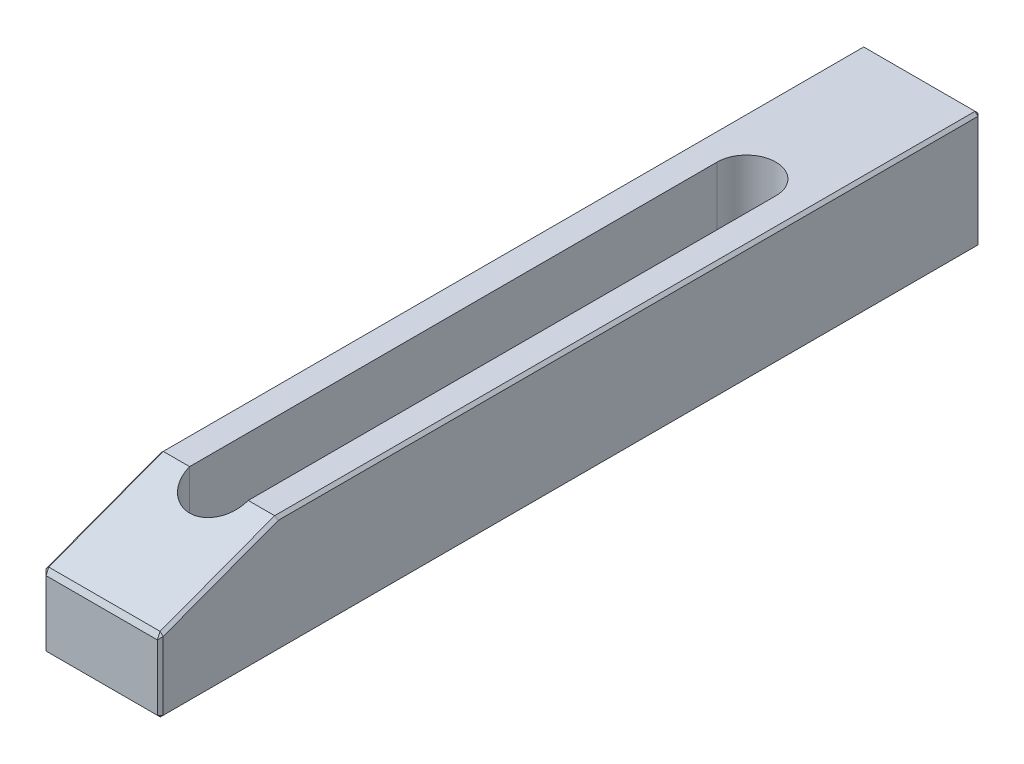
ISO-10303-21;
HEADER;
FILE_DESCRIPTION(('STEP AP214'),'2;1');
FILE_NAME('part.step','',(''),(''),'','','');
FILE_SCHEMA(('AUTOMOTIVE_DESIGN { 1 0 10303 214 1 1 1 1 }'));
ENDSEC;
DATA;
#1=APPLICATION_CONTEXT('core data for automotive mechanical design processes');
#2=APPLICATION_PROTOCOL_DEFINITION('international standard','automotive_design',2000,#1);
#3=PRODUCT_CONTEXT('',#1,'mechanical');
#4=PRODUCT('Part','Part','',(#3));
#5=PRODUCT_RELATED_PRODUCT_CATEGORY('part','',(#4));
#6=PRODUCT_DEFINITION_FORMATION('','',#4);
#7=PRODUCT_DEFINITION_CONTEXT('part definition',#1,'design');
#8=PRODUCT_DEFINITION('design','',#6,#7);
#9=PRODUCT_DEFINITION_SHAPE('','',#8);
#10=(LENGTH_UNIT() NAMED_UNIT(*) SI_UNIT(.MILLI.,.METRE.));
#11=(NAMED_UNIT(*) PLANE_ANGLE_UNIT() SI_UNIT($,.RADIAN.));
#12=(NAMED_UNIT(*) SI_UNIT($,.STERADIAN.) SOLID_ANGLE_UNIT());
#13=UNCERTAINTY_MEASURE_WITH_UNIT(LENGTH_MEASURE(1.E-05),#10,'distance_accuracy_value','');
#14=(GEOMETRIC_REPRESENTATION_CONTEXT(3) GLOBAL_UNCERTAINTY_ASSIGNED_CONTEXT((#13)) GLOBAL_UNIT_ASSIGNED_CONTEXT((#10,
#11,#12)) REPRESENTATION_CONTEXT('',''));
#15=CARTESIAN_POINT('',(0.,0.,0.));
#16=DIRECTION('',(0.,0.,1.));
#17=DIRECTION('',(1.,0.,0.));
#18=AXIS2_PLACEMENT_3D('',#15,#16,#17);
#19=CARTESIAN_POINT('',(20.,0.,0.));
#20=DIRECTION('',(0.,0.,1.));
#21=DIRECTION('',(1.,0.,0.));
#22=AXIS2_PLACEMENT_3D('',#19,#20,#21);
#23=PLANE('',#22);
#24=DIRECTION('',(0.,-1.,0.));
#25=VECTOR('',#24,1.);
#26=CARTESIAN_POINT('',(19.,0.,0.));
#27=LINE('',#26,#25);
#28=CARTESIAN_POINT('',(19.,39.,0.));
#29=VERTEX_POINT('',#28);
#30=CARTESIAN_POINT('',(19.,1.00000000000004,0.));
#31=VERTEX_POINT('',#30);
#32=EDGE_CURVE('E249',#29,#31,#27,.T.);
#33=ORIENTED_EDGE('',*,*,#32,.T.);
#34=DIRECTION('',(-1.,0.,0.));
#35=VECTOR('',#34,1.);
#36=CARTESIAN_POINT('',(20.,1.00000000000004,0.));
#37=LINE('',#36,#35);
#38=CARTESIAN_POINT('',(-19.,1.00000000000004,0.));
#39=VERTEX_POINT('',#38);
#40=EDGE_CURVE('E251',#31,#39,#37,.T.);
#41=ORIENTED_EDGE('',*,*,#40,.T.);
#42=DIRECTION('',(0.,1.,0.));
#43=VECTOR('',#42,1.);
#44=CARTESIAN_POINT('',(-19.,0.,0.));
#45=LINE('',#44,#43);
#46=CARTESIAN_POINT('',(-19.,39.,0.));
#47=VERTEX_POINT('',#46);
#48=EDGE_CURVE('E247',#39,#47,#45,.T.);
#49=ORIENTED_EDGE('',*,*,#48,.T.);
#50=DIRECTION('',(1.,0.,0.));
#51=VECTOR('',#50,1.);
#52=CARTESIAN_POINT('',(20.,39.,0.));
#53=LINE('',#52,#51);
#54=EDGE_CURVE('E245',#47,#29,#53,.T.);
#55=ORIENTED_EDGE('',*,*,#54,.T.);
#56=EDGE_LOOP('',(#33,#41,#49,#55));
#57=FACE_BOUND('',#56,.T.);
#58=ADVANCED_FACE('F30',(#57),#23,.F.);
#59=CARTESIAN_POINT('',(20.,40.,0.));
#60=DIRECTION('',(0.,-1.,0.));
#61=DIRECTION('',(0.,0.,-1.));
#62=AXIS2_PLACEMENT_3D('',#59,#60,#61);
#63=PLANE('',#62);
#64=CARTESIAN_POINT('',(0.,40.,60.));
#65=DIRECTION('',(0.,-1.,0.));
#66=DIRECTION('',(0.,0.,-1.));
#67=AXIS2_PLACEMENT_3D('',#64,#65,#66);
#68=CIRCLE('',#67,10.);
#69=CARTESIAN_POINT('',(-9.99999999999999,40.,60.));
#70=VERTEX_POINT('',#69);
#71=CARTESIAN_POINT('',(10.,40.,60.));
#72=VERTEX_POINT('',#71);
#73=EDGE_CURVE('E167',#70,#72,#68,.T.);
#74=ORIENTED_EDGE('',*,*,#73,.T.);
#75=DIRECTION('',(0.,0.,1.));
#76=VECTOR('',#75,1.);
#77=CARTESIAN_POINT('',(9.99999999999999,40.,240.));
#78=LINE('',#77,#76);
#79=CARTESIAN_POINT('',(9.99999999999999,40.,240.));
#80=VERTEX_POINT('',#79);
#81=EDGE_CURVE('E172',#72,#80,#78,.T.);
#82=ORIENTED_EDGE('',*,*,#81,.T.);
#83=DIRECTION('',(-1.,0.,0.));
#84=VECTOR('',#83,1.);
#85=CARTESIAN_POINT('',(20.,40.,240.));
#86=LINE('',#85,#84);
#87=CARTESIAN_POINT('',(19.,40.,240.));
#88=VERTEX_POINT('',#87);
#89=EDGE_CURVE('E195',#88,#80,#86,.T.);
#90=ORIENTED_EDGE('',*,*,#89,.F.);
#91=DIRECTION('',(0.,0.,-1.));
#92=VECTOR('',#91,1.);
#93=CARTESIAN_POINT('',(19.,40.,0.));
#94=LINE('',#93,#92);
#95=CARTESIAN_POINT('',(19.,40.,1.00000000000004));
#96=VERTEX_POINT('',#95);
#97=EDGE_CURVE('E254',#88,#96,#94,.T.);
#98=ORIENTED_EDGE('',*,*,#97,.T.);
#99=DIRECTION('',(-1.,0.,0.));
#100=VECTOR('',#99,1.);
#101=CARTESIAN_POINT('',(20.,40.,1.00000000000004));
#102=LINE('',#101,#100);
#103=CARTESIAN_POINT('',(-19.,40.,1.00000000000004));
#104=VERTEX_POINT('',#103);
#105=EDGE_CURVE('E39',#96,#104,#102,.T.);
#106=ORIENTED_EDGE('',*,*,#105,.T.);
#107=DIRECTION('',(0.,0.,1.));
#108=VECTOR('',#107,1.);
#109=CARTESIAN_POINT('',(-19.,40.,0.));
#110=LINE('',#109,#108);
#111=CARTESIAN_POINT('',(-19.,40.,240.));
#112=VERTEX_POINT('',#111);
#113=EDGE_CURVE('E11',#104,#112,#110,.T.);
#114=ORIENTED_EDGE('',*,*,#113,.T.);
#115=CARTESIAN_POINT('',(-10.,40.,240.));
#116=VERTEX_POINT('',#115);
#117=EDGE_CURVE('E176',#116,#112,#86,.T.);
#118=ORIENTED_EDGE('',*,*,#117,.F.);
#119=DIRECTION('',(0.,0.,-1.));
#120=VECTOR('',#119,1.);
#121=CARTESIAN_POINT('',(-10.,40.,240.));
#122=LINE('',#121,#120);
#123=EDGE_CURVE('E47',#116,#70,#122,.T.);
#124=ORIENTED_EDGE('',*,*,#123,.T.);
#125=EDGE_LOOP('',(#74,#82,#90,#98,#106,#114,#118,#124));
#126=FACE_BOUND('',#125,.T.);
#127=ADVANCED_FACE('F175',(#126),#63,.F.);
#128=CARTESIAN_POINT('',(20.,25.,280.));
#129=DIRECTION('',(0.,-0.936329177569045,-0.351123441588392));
#130=DIRECTION('',(0.,0.351123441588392,-0.936329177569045));
#131=AXIS2_PLACEMENT_3D('',#128,#129,#130);
#132=PLANE('',#131);
#133=ORIENTED_EDGE('',*,*,#89,.T.);
#134=CARTESIAN_POINT('',(0.,40.,240.));
#135=DIRECTION('',(0.,-0.936329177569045,-0.351123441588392));
#136=DIRECTION('',(0.,-0.351123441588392,0.936329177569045));
#137=AXIS2_PLACEMENT_3D('',#134,#135,#136);
#138=ELLIPSE('',#137,10.6800046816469,10.);
#139=EDGE_CURVE('E189',#80,#116,#138,.T.);
#140=ORIENTED_EDGE('',*,*,#139,.T.);
#141=ORIENTED_EDGE('',*,*,#117,.T.);
#142=DIRECTION('',(0.,-0.351123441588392,0.936329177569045));
#143=VECTOR('',#142,1.);
#144=CARTESIAN_POINT('',(-19.,25.,280.));
#145=LINE('',#144,#143);
#146=CARTESIAN_POINT('',(-19.,25.3511234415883,279.063670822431));
#147=VERTEX_POINT('',#146);
#148=EDGE_CURVE('E212',#112,#147,#145,.T.);
#149=ORIENTED_EDGE('',*,*,#148,.T.);
#150=DIRECTION('',(1.,0.,0.));
#151=VECTOR('',#150,1.);
#152=CARTESIAN_POINT('',(20.,25.3511234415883,279.063670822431));
#153=LINE('',#152,#151);
#154=CARTESIAN_POINT('',(19.,25.3511234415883,279.063670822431));
#155=VERTEX_POINT('',#154);
#156=EDGE_CURVE('E209',#147,#155,#153,.T.);
#157=ORIENTED_EDGE('',*,*,#156,.T.);
#158=DIRECTION('',(0.,0.351123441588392,-0.936329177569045));
#159=VECTOR('',#158,1.);
#160=CARTESIAN_POINT('',(19.,40.,240.));
#161=LINE('',#160,#159);
#162=EDGE_CURVE('E207',#155,#88,#161,.T.);
#163=ORIENTED_EDGE('',*,*,#162,.T.);
#164=EDGE_LOOP('',(#133,#140,#141,#149,#157,#163));
#165=FACE_BOUND('',#164,.T.);
#166=ADVANCED_FACE('F330',(#165),#132,.F.);
#167=CARTESIAN_POINT('',(20.,0.,280.));
#168=DIRECTION('',(0.,0.,-1.));
#169=DIRECTION('',(-1.,0.,0.));
#170=AXIS2_PLACEMENT_3D('',#167,#168,#169);
#171=PLANE('',#170);
#172=DIRECTION('',(0.,1.,0.));
#173=VECTOR('',#172,1.);
#174=CARTESIAN_POINT('',(19.,25.,280.));
#175=LINE('',#174,#173);
#176=CARTESIAN_POINT('',(19.,0.999999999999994,280.));
#177=VERTEX_POINT('',#176);
#178=CARTESIAN_POINT('',(19.,23.2911992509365,280.));
#179=VERTEX_POINT('',#178);
#180=EDGE_CURVE('E202',#177,#179,#175,.T.);
#181=ORIENTED_EDGE('',*,*,#180,.T.);
#182=DIRECTION('',(-1.,0.,0.));
#183=VECTOR('',#182,1.);
#184=CARTESIAN_POINT('',(20.,23.2911992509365,280.));
#185=LINE('',#184,#183);
#186=CARTESIAN_POINT('',(-19.,23.2911992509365,280.));
#187=VERTEX_POINT('',#186);
#188=EDGE_CURVE('E204',#179,#187,#185,.T.);
#189=ORIENTED_EDGE('',*,*,#188,.T.);
#190=DIRECTION('',(0.,-1.,0.));
#191=VECTOR('',#190,1.);
#192=CARTESIAN_POINT('',(-19.,0.,280.));
#193=LINE('',#192,#191);
#194=CARTESIAN_POINT('',(-19.,0.999999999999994,280.));
#195=VERTEX_POINT('',#194);
#196=EDGE_CURVE('E200',#187,#195,#193,.T.);
#197=ORIENTED_EDGE('',*,*,#196,.T.);
#198=DIRECTION('',(1.,0.,0.));
#199=VECTOR('',#198,1.);
#200=CARTESIAN_POINT('',(20.,0.999999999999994,280.));
#201=LINE('',#200,#199);
#202=EDGE_CURVE('E198',#195,#177,#201,.T.);
#203=ORIENTED_EDGE('',*,*,#202,.T.);
#204=EDGE_LOOP('',(#181,#189,#197,#203));
#205=FACE_BOUND('',#204,.T.);
#206=ADVANCED_FACE('F359',(#205),#171,.F.);
#207=CARTESIAN_POINT('',(20.,0.,0.));
#208=DIRECTION('',(0.,1.,0.));
#209=DIRECTION('',(0.,0.,1.));
#210=AXIS2_PLACEMENT_3D('',#207,#208,#209);
#211=PLANE('',#210);
#212=DIRECTION('',(0.,0.,-1.));
#213=VECTOR('',#212,1.);
#214=CARTESIAN_POINT('',(-10.,0.,240.));
#215=LINE('',#214,#213);
#216=CARTESIAN_POINT('',(-10.,0.,240.));
#217=VERTEX_POINT('',#216);
#218=CARTESIAN_POINT('',(-9.99999999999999,0.,60.));
#219=VERTEX_POINT('',#218);
#220=EDGE_CURVE('E159',#217,#219,#215,.T.);
#221=ORIENTED_EDGE('',*,*,#220,.F.);
#222=CARTESIAN_POINT('',(0.,0.,240.));
#223=DIRECTION('',(0.,-1.,0.));
#224=DIRECTION('',(0.,0.,-1.));
#225=AXIS2_PLACEMENT_3D('',#222,#223,#224);
#226=CIRCLE('',#225,10.);
#227=CARTESIAN_POINT('',(9.99999999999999,0.,240.));
#228=VERTEX_POINT('',#227);
#229=EDGE_CURVE('E54',#228,#217,#226,.T.);
#230=ORIENTED_EDGE('',*,*,#229,.F.);
#231=DIRECTION('',(0.,0.,1.));
#232=VECTOR('',#231,1.);
#233=CARTESIAN_POINT('',(9.99999999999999,0.,240.));
#234=LINE('',#233,#232);
#235=CARTESIAN_POINT('',(10.,0.,60.));
#236=VERTEX_POINT('',#235);
#237=EDGE_CURVE('E177',#236,#228,#234,.T.);
#238=ORIENTED_EDGE('',*,*,#237,.F.);
#239=CARTESIAN_POINT('',(0.,0.,60.));
#240=DIRECTION('',(0.,-1.,0.));
#241=DIRECTION('',(0.,0.,-1.));
#242=AXIS2_PLACEMENT_3D('',#239,#240,#241);
#243=CIRCLE('',#242,10.);
#244=EDGE_CURVE('E180',#219,#236,#243,.T.);
#245=ORIENTED_EDGE('',*,*,#244,.F.);
#246=EDGE_LOOP('',(#221,#230,#238,#245));
#247=FACE_BOUND('',#246,.T.);
#248=DIRECTION('',(0.,0.,1.));
#249=VECTOR('',#248,1.);
#250=CARTESIAN_POINT('',(19.,0.,280.));
#251=LINE('',#250,#249);
#252=CARTESIAN_POINT('',(19.,0.,1.00000000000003));
#253=VERTEX_POINT('',#252);
#254=CARTESIAN_POINT('',(19.,0.,279.));
#255=VERTEX_POINT('',#254);
#256=EDGE_CURVE('E240',#253,#255,#251,.T.);
#257=ORIENTED_EDGE('',*,*,#256,.T.);
#258=DIRECTION('',(-1.,0.,0.));
#259=VECTOR('',#258,1.);
#260=CARTESIAN_POINT('',(20.,0.,279.));
#261=LINE('',#260,#259);
#262=CARTESIAN_POINT('',(-19.,0.,279.));
#263=VERTEX_POINT('',#262);
#264=EDGE_CURVE('E242',#255,#263,#261,.T.);
#265=ORIENTED_EDGE('',*,*,#264,.T.);
#266=DIRECTION('',(0.,0.,-1.));
#267=VECTOR('',#266,1.);
#268=CARTESIAN_POINT('',(-19.,0.,0.));
#269=LINE('',#268,#267);
#270=CARTESIAN_POINT('',(-19.,0.,1.00000000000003));
#271=VERTEX_POINT('',#270);
#272=EDGE_CURVE('E238',#263,#271,#269,.T.);
#273=ORIENTED_EDGE('',*,*,#272,.T.);
#274=DIRECTION('',(1.,0.,0.));
#275=VECTOR('',#274,1.);
#276=CARTESIAN_POINT('',(20.,0.,1.00000000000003));
#277=LINE('',#276,#275);
#278=EDGE_CURVE('E236',#271,#253,#277,.T.);
#279=ORIENTED_EDGE('',*,*,#278,.T.);
#280=EDGE_LOOP('',(#257,#265,#273,#279));
#281=FACE_BOUND('',#280,.T.);
#282=ADVANCED_FACE('F659',(#247,#281),#211,.F.);
#283=CARTESIAN_POINT('',(20.,40.,0.));
#284=DIRECTION('',(1.,0.,0.));
#285=DIRECTION('',(0.,0.,-1.));
#286=AXIS2_PLACEMENT_3D('',#283,#284,#285);
#287=PLANE('',#286);
#288=DIRECTION('',(0.,-0.351123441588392,0.936329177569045));
#289=VECTOR('',#288,1.);
#290=CARTESIAN_POINT('',(20.,24.0636708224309,279.648876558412));
#291=LINE('',#290,#289);
#292=CARTESIAN_POINT('',(20.,38.9999999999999,239.818665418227));
#293=VERTEX_POINT('',#292);
#294=CARTESIAN_POINT('',(20.,24.3069995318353,279.));
#295=VERTEX_POINT('',#294);
#296=EDGE_CURVE('E214',#293,#295,#291,.T.);
#297=ORIENTED_EDGE('',*,*,#296,.T.);
#298=DIRECTION('',(0.,-1.,0.));
#299=VECTOR('',#298,1.);
#300=CARTESIAN_POINT('',(20.,0.,279.));
#301=LINE('',#300,#299);
#302=CARTESIAN_POINT('',(20.,1.00000000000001,279.));
#303=VERTEX_POINT('',#302);
#304=EDGE_CURVE('E222',#295,#303,#301,.T.);
#305=ORIENTED_EDGE('',*,*,#304,.T.);
#306=DIRECTION('',(0.,0.,-1.));
#307=VECTOR('',#306,1.);
#308=CARTESIAN_POINT('',(20.,1.00000000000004,0.));
#309=LINE('',#308,#307);
#310=CARTESIAN_POINT('',(20.,1.00000000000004,1.00000000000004));
#311=VERTEX_POINT('',#310);
#312=EDGE_CURVE('E220',#303,#311,#309,.T.);
#313=ORIENTED_EDGE('',*,*,#312,.T.);
#314=DIRECTION('',(0.,1.,0.));
#315=VECTOR('',#314,1.);
#316=CARTESIAN_POINT('',(20.,40.,1.00000000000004));
#317=LINE('',#316,#315);
#318=CARTESIAN_POINT('',(20.,39.,1.00000000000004));
#319=VERTEX_POINT('',#318);
#320=EDGE_CURVE('E218',#311,#319,#317,.T.);
#321=ORIENTED_EDGE('',*,*,#320,.T.);
#322=DIRECTION('',(0.,0.,1.));
#323=VECTOR('',#322,1.);
#324=CARTESIAN_POINT('',(20.,38.9999999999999,240.));
#325=LINE('',#324,#323);
#326=EDGE_CURVE('E216',#319,#293,#325,.T.);
#327=ORIENTED_EDGE('',*,*,#326,.T.);
#328=EDGE_LOOP('',(#297,#305,#313,#321,#327));
#329=FACE_BOUND('',#328,.T.);
#330=ADVANCED_FACE('F419',(#329),#287,.T.);
#331=CARTESIAN_POINT('',(-20.,40.,0.));
#332=DIRECTION('',(1.,0.,0.));
#333=DIRECTION('',(0.,0.,-1.));
#334=AXIS2_PLACEMENT_3D('',#331,#332,#333);
#335=PLANE('',#334);
#336=DIRECTION('',(0.,0.,1.));
#337=VECTOR('',#336,1.);
#338=CARTESIAN_POINT('',(-20.,1.00000000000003,0.));
#339=LINE('',#338,#337);
#340=CARTESIAN_POINT('',(-20.,1.00000000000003,1.00000000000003));
#341=VERTEX_POINT('',#340);
#342=CARTESIAN_POINT('',(-20.,0.999999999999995,279.));
#343=VERTEX_POINT('',#342);
#344=EDGE_CURVE('E231',#341,#343,#339,.T.);
#345=ORIENTED_EDGE('',*,*,#344,.T.);
#346=DIRECTION('',(0.,1.,0.));
#347=VECTOR('',#346,1.);
#348=CARTESIAN_POINT('',(-20.,40.,279.));
#349=LINE('',#348,#347);
#350=CARTESIAN_POINT('',(-20.,24.3069995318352,279.));
#351=VERTEX_POINT('',#350);
#352=EDGE_CURVE('E233',#343,#351,#349,.T.);
#353=ORIENTED_EDGE('',*,*,#352,.T.);
#354=DIRECTION('',(0.,0.351123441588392,-0.936329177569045));
#355=VECTOR('',#354,1.);
#356=CARTESIAN_POINT('',(-20.,117.967780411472,29.237917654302));
#357=LINE('',#356,#355);
#358=CARTESIAN_POINT('',(-20.,38.9999999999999,239.818665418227));
#359=VERTEX_POINT('',#358);
#360=EDGE_CURVE('E227',#351,#359,#357,.T.);
#361=ORIENTED_EDGE('',*,*,#360,.T.);
#362=DIRECTION('',(0.,0.,-1.));
#363=VECTOR('',#362,1.);
#364=CARTESIAN_POINT('',(-20.,39.,0.));
#365=LINE('',#364,#363);
#366=CARTESIAN_POINT('',(-20.,39.,1.00000000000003));
#367=VERTEX_POINT('',#366);
#368=EDGE_CURVE('E225',#359,#367,#365,.T.);
#369=ORIENTED_EDGE('',*,*,#368,.T.);
#370=DIRECTION('',(0.,-1.,0.));
#371=VECTOR('',#370,1.);
#372=CARTESIAN_POINT('',(-20.,40.,1.00000000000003));
#373=LINE('',#372,#371);
#374=EDGE_CURVE('E229',#367,#341,#373,.T.);
#375=ORIENTED_EDGE('',*,*,#374,.T.);
#376=EDGE_LOOP('',(#345,#353,#361,#369,#375));
#377=FACE_BOUND('',#376,.T.);
#378=ADVANCED_FACE('F397',(#377),#335,.F.);
#379=CARTESIAN_POINT('',(20.,1.00000000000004,0.));
#380=DIRECTION('',(0.,0.707106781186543,0.707106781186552));
#381=DIRECTION('',(0.,-0.707106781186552,0.707106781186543));
#382=AXIS2_PLACEMENT_3D('',#379,#380,#381);
#383=PLANE('',#382);
#384=DIRECTION('',(0.,0.707106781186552,-0.707106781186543));
#385=VECTOR('',#384,1.);
#386=CARTESIAN_POINT('',(-19.,0.,1.00000000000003));
#387=LINE('',#386,#385);
#388=EDGE_CURVE('E320',#39,#271,#387,.F.);
#389=ORIENTED_EDGE('',*,*,#388,.F.);
#390=ORIENTED_EDGE('',*,*,#40,.F.);
#391=DIRECTION('',(0.,-0.707106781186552,0.707106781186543));
#392=VECTOR('',#391,1.);
#393=CARTESIAN_POINT('',(19.,0.500000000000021,0.500000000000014));
#394=LINE('',#393,#392);
#395=EDGE_CURVE('E322',#253,#31,#394,.F.);
#396=ORIENTED_EDGE('',*,*,#395,.F.);
#397=ORIENTED_EDGE('',*,*,#278,.F.);
#398=EDGE_LOOP('',(#389,#390,#396,#397));
#399=FACE_BOUND('',#398,.T.);
#400=ADVANCED_FACE('F32',(#399),#383,.F.);
#401=CARTESIAN_POINT('',(20.,40.,1.00000000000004));
#402=DIRECTION('',(0.707106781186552,0.,-0.707106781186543));
#403=DIRECTION('',(-0.707106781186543,0.,-0.707106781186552));
#404=AXIS2_PLACEMENT_3D('',#401,#402,#403);
#405=PLANE('',#404);
#406=DIRECTION('',(0.707106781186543,0.,0.707106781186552));
#407=VECTOR('',#406,1.);
#408=CARTESIAN_POINT('',(20.,1.00000000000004,1.00000000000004));
#409=LINE('',#408,#407);
#410=EDGE_CURVE('E34',#31,#311,#409,.T.);
#411=ORIENTED_EDGE('',*,*,#410,.F.);
#412=ORIENTED_EDGE('',*,*,#32,.F.);
#413=DIRECTION('',(-0.707106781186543,0.,-0.707106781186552));
#414=VECTOR('',#413,1.);
#415=CARTESIAN_POINT('',(20.,39.,1.00000000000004));
#416=LINE('',#415,#414);
#417=EDGE_CURVE('E311',#319,#29,#416,.T.);
#418=ORIENTED_EDGE('',*,*,#417,.F.);
#419=ORIENTED_EDGE('',*,*,#320,.F.);
#420=EDGE_LOOP('',(#411,#412,#418,#419));
#421=FACE_BOUND('',#420,.T.);
#422=ADVANCED_FACE('F422',(#421),#405,.T.);
#423=CARTESIAN_POINT('',(20.,1.00000000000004,1.00000000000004));
#424=DIRECTION('',(0.577350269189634,-0.577350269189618,-0.577350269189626));
#425=DIRECTION('',(-0.707106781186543,0.,-0.707106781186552));
#426=AXIS2_PLACEMENT_3D('',#423,#424,#425);
#427=PLANE('',#426);
#428=ORIENTED_EDGE('',*,*,#395,.T.);
#429=ORIENTED_EDGE('',*,*,#410,.T.);
#430=DIRECTION('',(-0.707106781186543,-0.707106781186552,0.));
#431=VECTOR('',#430,1.);
#432=CARTESIAN_POINT('',(20.,1.00000000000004,1.00000000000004));
#433=LINE('',#432,#431);
#434=EDGE_CURVE('E308',#253,#311,#433,.F.);
#435=ORIENTED_EDGE('',*,*,#434,.F.);
#436=EDGE_LOOP('',(#428,#429,#435));
#437=FACE_BOUND('',#436,.T.);
#438=ADVANCED_FACE('F431',(#437),#427,.T.);
#439=CARTESIAN_POINT('',(-19.,0.,1.00000000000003));
#440=DIRECTION('',(-0.577350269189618,-0.577350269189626,-0.577350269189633));
#441=DIRECTION('',(0.,0.707106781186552,-0.707106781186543));
#442=AXIS2_PLACEMENT_3D('',#439,#440,#441);
#443=PLANE('',#442);
#444=DIRECTION('',(0.707106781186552,-0.707106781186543,0.));
#445=VECTOR('',#444,1.);
#446=CARTESIAN_POINT('',(-19.,0.,1.00000000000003));
#447=LINE('',#446,#445);
#448=EDGE_CURVE('E305',#341,#271,#447,.T.);
#449=ORIENTED_EDGE('',*,*,#448,.F.);
#450=DIRECTION('',(-0.707106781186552,0.,0.707106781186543));
#451=VECTOR('',#450,1.);
#452=CARTESIAN_POINT('',(-19.5,1.00000000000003,0.500000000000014));
#453=LINE('',#452,#451);
#454=EDGE_CURVE('E317',#39,#341,#453,.T.);
#455=ORIENTED_EDGE('',*,*,#454,.F.);
#456=ORIENTED_EDGE('',*,*,#388,.T.);
#457=EDGE_LOOP('',(#449,#455,#456));
#458=FACE_BOUND('',#457,.T.);
#459=ADVANCED_FACE('F429',(#458),#443,.T.);
#460=CARTESIAN_POINT('',(-19.,0.,0.));
#461=DIRECTION('',(0.707106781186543,0.,0.707106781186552));
#462=DIRECTION('',(0.707106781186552,0.,-0.707106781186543));
#463=AXIS2_PLACEMENT_3D('',#460,#461,#462);
#464=PLANE('',#463);
#465=ORIENTED_EDGE('',*,*,#454,.T.);
#466=ORIENTED_EDGE('',*,*,#374,.F.);
#467=DIRECTION('',(0.707106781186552,0.,-0.707106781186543));
#468=VECTOR('',#467,1.);
#469=CARTESIAN_POINT('',(-19.,39.,0.));
#470=LINE('',#469,#468);
#471=EDGE_CURVE('E302',#47,#367,#470,.F.);
#472=ORIENTED_EDGE('',*,*,#471,.F.);
#473=ORIENTED_EDGE('',*,*,#48,.F.);
#474=EDGE_LOOP('',(#465,#466,#472,#473));
#475=FACE_BOUND('',#474,.T.);
#476=ADVANCED_FACE('F393',(#475),#464,.F.);
#477=CARTESIAN_POINT('',(20.,40.,1.00000000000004));
#478=DIRECTION('',(0.,-0.707106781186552,0.707106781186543));
#479=DIRECTION('',(0.,-0.707106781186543,-0.707106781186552));
#480=AXIS2_PLACEMENT_3D('',#477,#478,#479);
#481=PLANE('',#480);
#482=DIRECTION('',(0.,-0.707106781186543,-0.707106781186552));
#483=VECTOR('',#482,1.);
#484=CARTESIAN_POINT('',(19.,39.5,0.50000000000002));
#485=LINE('',#484,#483);
#486=EDGE_CURVE('E314',#29,#96,#485,.F.);
#487=ORIENTED_EDGE('',*,*,#486,.F.);
#488=ORIENTED_EDGE('',*,*,#54,.F.);
#489=DIRECTION('',(0.,0.707106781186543,0.707106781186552));
#490=VECTOR('',#489,1.);
#491=CARTESIAN_POINT('',(-19.,39.,0.));
#492=LINE('',#491,#490);
#493=EDGE_CURVE('E299',#104,#47,#492,.F.);
#494=ORIENTED_EDGE('',*,*,#493,.F.);
#495=ORIENTED_EDGE('',*,*,#105,.F.);
#496=EDGE_LOOP('',(#487,#488,#494,#495));
#497=FACE_BOUND('',#496,.T.);
#498=ADVANCED_FACE('F386',(#497),#481,.F.);
#499=CARTESIAN_POINT('',(20.,39.,1.00000000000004));
#500=DIRECTION('',(0.577350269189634,0.577350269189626,-0.577350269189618));
#501=DIRECTION('',(-0.707106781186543,0.707106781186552,0.));
#502=AXIS2_PLACEMENT_3D('',#499,#500,#501);
#503=PLANE('',#502);
#504=ORIENTED_EDGE('',*,*,#417,.T.);
#505=ORIENTED_EDGE('',*,*,#486,.T.);
#506=DIRECTION('',(0.707106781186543,-0.707106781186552,0.));
#507=VECTOR('',#506,1.);
#508=CARTESIAN_POINT('',(20.,39.,1.00000000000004));
#509=LINE('',#508,#507);
#510=EDGE_CURVE('E296',#319,#96,#509,.F.);
#511=ORIENTED_EDGE('',*,*,#510,.F.);
#512=EDGE_LOOP('',(#504,#505,#511));
#513=FACE_BOUND('',#512,.T.);
#514=ADVANCED_FACE('F381',(#513),#503,.T.);
#515=CARTESIAN_POINT('',(20.,1.00000000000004,0.));
#516=DIRECTION('',(0.707106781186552,-0.707106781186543,0.));
#517=DIRECTION('',(0.707106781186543,0.707106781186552,0.));
#518=AXIS2_PLACEMENT_3D('',#515,#516,#517);
#519=PLANE('',#518);
#520=ORIENTED_EDGE('',*,*,#434,.T.);
#521=ORIENTED_EDGE('',*,*,#312,.F.);
#522=DIRECTION('',(0.707106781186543,0.707106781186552,0.));
#523=VECTOR('',#522,1.);
#524=CARTESIAN_POINT('',(20.,1.00000000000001,279.));
#525=LINE('',#524,#523);
#526=EDGE_CURVE('E293',#255,#303,#525,.T.);
#527=ORIENTED_EDGE('',*,*,#526,.F.);
#528=ORIENTED_EDGE('',*,*,#256,.F.);
#529=EDGE_LOOP('',(#520,#521,#527,#528));
#530=FACE_BOUND('',#529,.T.);
#531=ADVANCED_FACE('F416',(#530),#519,.T.);
#532=CARTESIAN_POINT('',(20.,0.,279.));
#533=DIRECTION('',(0.,0.707106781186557,-0.707106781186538));
#534=DIRECTION('',(0.,0.707106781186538,0.707106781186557));
#535=AXIS2_PLACEMENT_3D('',#532,#533,#534);
#536=PLANE('',#535);
#537=DIRECTION('',(0.,-0.707106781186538,-0.707106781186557));
#538=VECTOR('',#537,1.);
#539=CARTESIAN_POINT('',(-19.,0.999999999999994,280.));
#540=LINE('',#539,#538);
#541=EDGE_CURVE('E287',#263,#195,#540,.F.);
#542=ORIENTED_EDGE('',*,*,#541,.F.);
#543=ORIENTED_EDGE('',*,*,#264,.F.);
#544=DIRECTION('',(0.,0.707106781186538,0.707106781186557));
#545=VECTOR('',#544,1.);
#546=CARTESIAN_POINT('',(19.,0.499999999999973,279.5));
#547=LINE('',#546,#545);
#548=EDGE_CURVE('E290',#177,#255,#547,.F.);
#549=ORIENTED_EDGE('',*,*,#548,.F.);
#550=ORIENTED_EDGE('',*,*,#202,.F.);
#551=EDGE_LOOP('',(#542,#543,#549,#550));
#552=FACE_BOUND('',#551,.T.);
#553=ADVANCED_FACE('F408',(#552),#536,.F.);
#554=CARTESIAN_POINT('',(-19.,0.,0.));
#555=DIRECTION('',(0.707106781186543,0.707106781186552,0.));
#556=DIRECTION('',(-0.707106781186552,0.707106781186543,0.));
#557=AXIS2_PLACEMENT_3D('',#554,#555,#556);
#558=PLANE('',#557);
#559=ORIENTED_EDGE('',*,*,#448,.T.);
#560=ORIENTED_EDGE('',*,*,#272,.F.);
#561=DIRECTION('',(-0.707106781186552,0.707106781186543,0.));
#562=VECTOR('',#561,1.);
#563=CARTESIAN_POINT('',(-19.5,0.500000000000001,279.));
#564=LINE('',#563,#562);
#565=EDGE_CURVE('E285',#343,#263,#564,.F.);
#566=ORIENTED_EDGE('',*,*,#565,.F.);
#567=ORIENTED_EDGE('',*,*,#344,.F.);
#568=EDGE_LOOP('',(#559,#560,#566,#567));
#569=FACE_BOUND('',#568,.T.);
#570=ADVANCED_FACE('F402',(#569),#558,.F.);
#571=CARTESIAN_POINT('',(-19.,39.,0.));
#572=DIRECTION('',(-0.577350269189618,0.577350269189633,-0.577350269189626));
#573=DIRECTION('',(0.,0.707106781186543,0.707106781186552));
#574=AXIS2_PLACEMENT_3D('',#571,#572,#573);
#575=PLANE('',#574);
#576=ORIENTED_EDGE('',*,*,#493,.T.);
#577=ORIENTED_EDGE('',*,*,#471,.T.);
#578=DIRECTION('',(-0.707106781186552,-0.707106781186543,0.));
#579=VECTOR('',#578,1.);
#580=CARTESIAN_POINT('',(-19.5,39.5,1.00000000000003));
#581=LINE('',#580,#579);
#582=EDGE_CURVE('E282',#104,#367,#581,.T.);
#583=ORIENTED_EDGE('',*,*,#582,.F.);
#584=EDGE_LOOP('',(#576,#577,#583));
#585=FACE_BOUND('',#584,.T.);
#586=ADVANCED_FACE('F390',(#585),#575,.T.);
#587=CARTESIAN_POINT('',(20.,39.,0.));
#588=DIRECTION('',(0.707106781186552,0.707106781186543,0.));
#589=DIRECTION('',(-0.707106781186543,0.707106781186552,0.));
#590=AXIS2_PLACEMENT_3D('',#587,#588,#589);
#591=PLANE('',#590);
#592=ORIENTED_EDGE('',*,*,#510,.T.);
#593=ORIENTED_EDGE('',*,*,#97,.F.);
#594=DIRECTION('',(-0.701364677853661,0.701364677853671,0.127181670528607));
#595=VECTOR('',#594,1.);
#596=CARTESIAN_POINT('',(-0.0612745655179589,59.0612745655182,243.456468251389));
#597=LINE('',#596,#595);
#598=EDGE_CURVE('E279',#293,#88,#597,.T.);
#599=ORIENTED_EDGE('',*,*,#598,.F.);
#600=ORIENTED_EDGE('',*,*,#326,.F.);
#601=EDGE_LOOP('',(#592,#593,#599,#600));
#602=FACE_BOUND('',#601,.T.);
#603=ADVANCED_FACE('F377',(#602),#591,.T.);
#604=CARTESIAN_POINT('',(20.,1.00000000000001,279.));
#605=DIRECTION('',(0.577350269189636,-0.577350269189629,0.577350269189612));
#606=DIRECTION('',(0.707106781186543,0.707106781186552,0.));
#607=AXIS2_PLACEMENT_3D('',#604,#605,#606);
#608=PLANE('',#607);
#609=ORIENTED_EDGE('',*,*,#548,.T.);
#610=ORIENTED_EDGE('',*,*,#526,.T.);
#611=DIRECTION('',(-0.707106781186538,0.,0.707106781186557));
#612=VECTOR('',#611,1.);
#613=CARTESIAN_POINT('',(20.,1.00000000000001,279.));
#614=LINE('',#613,#612);
#615=EDGE_CURVE('E277',#177,#303,#614,.F.);
#616=ORIENTED_EDGE('',*,*,#615,.F.);
#617=EDGE_LOOP('',(#609,#610,#616));
#618=FACE_BOUND('',#617,.T.);
#619=ADVANCED_FACE('F412',(#618),#608,.T.);
#620=CARTESIAN_POINT('',(-19.,0.999999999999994,280.));
#621=DIRECTION('',(-0.577350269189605,-0.577350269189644,0.577350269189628));
#622=DIRECTION('',(0.,-0.707106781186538,-0.707106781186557));
#623=AXIS2_PLACEMENT_3D('',#620,#621,#622);
#624=PLANE('',#623);
#625=ORIENTED_EDGE('',*,*,#565,.T.);
#626=ORIENTED_EDGE('',*,*,#541,.T.);
#627=DIRECTION('',(0.707106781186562,0.,0.707106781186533));
#628=VECTOR('',#627,1.);
#629=CARTESIAN_POINT('',(-19.,0.999999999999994,280.));
#630=LINE('',#629,#628);
#631=EDGE_CURVE('E274',#343,#195,#630,.T.);
#632=ORIENTED_EDGE('',*,*,#631,.F.);
#633=EDGE_LOOP('',(#625,#626,#632));
#634=FACE_BOUND('',#633,.T.);
#635=ADVANCED_FACE('F405',(#634),#624,.T.);
#636=CARTESIAN_POINT('',(-19.,40.,0.));
#637=DIRECTION('',(0.707106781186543,-0.707106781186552,0.));
#638=DIRECTION('',(0.707106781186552,0.707106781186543,0.));
#639=AXIS2_PLACEMENT_3D('',#636,#637,#638);
#640=PLANE('',#639);
#641=ORIENTED_EDGE('',*,*,#582,.T.);
#642=ORIENTED_EDGE('',*,*,#368,.F.);
#643=DIRECTION('',(0.701364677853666,0.701364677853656,0.127181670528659));
#644=VECTOR('',#643,1.);
#645=CARTESIAN_POINT('',(-40.4081755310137,18.5918244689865,236.117957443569));
#646=LINE('',#645,#644);
#647=EDGE_CURVE('E271',#112,#359,#646,.F.);
#648=ORIENTED_EDGE('',*,*,#647,.F.);
#649=ORIENTED_EDGE('',*,*,#113,.F.);
#650=EDGE_LOOP('',(#641,#642,#648,#649));
#651=FACE_BOUND('',#650,.T.);
#652=ADVANCED_FACE('F339',(#651),#640,.F.);
#653=CARTESIAN_POINT('',(20.,117.967780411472,29.237917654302));
#654=DIRECTION('',(0.707106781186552,0.66208471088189,0.248281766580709));
#655=DIRECTION('',(-0.683486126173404,0.729963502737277,0.));
#656=AXIS2_PLACEMENT_3D('',#653,#654,#655);
#657=PLANE('',#656);
#658=ORIENTED_EDGE('',*,*,#598,.T.);
#659=ORIENTED_EDGE('',*,*,#162,.F.);
#660=DIRECTION('',(-0.69101244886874,0.721502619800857,0.0439973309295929));
#661=VECTOR('',#660,1.);
#662=CARTESIAN_POINT('',(19.,25.3511234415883,279.063670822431));
#663=LINE('',#662,#661);
#664=EDGE_CURVE('E268',#295,#155,#663,.T.);
#665=ORIENTED_EDGE('',*,*,#664,.F.);
#666=ORIENTED_EDGE('',*,*,#296,.F.);
#667=EDGE_LOOP('',(#658,#659,#665,#666));
#668=FACE_BOUND('',#667,.T.);
#669=ADVANCED_FACE('F372',(#668),#657,.T.);
#670=CARTESIAN_POINT('',(20.,40.,279.));
#671=DIRECTION('',(0.707106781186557,0.,0.707106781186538));
#672=DIRECTION('',(0.707106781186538,0.,-0.707106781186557));
#673=AXIS2_PLACEMENT_3D('',#670,#671,#672);
#674=PLANE('',#673);
#675=ORIENTED_EDGE('',*,*,#615,.T.);
#676=ORIENTED_EDGE('',*,*,#304,.F.);
#677=DIRECTION('',(0.574309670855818,0.583383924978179,-0.574309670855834));
#678=VECTOR('',#677,1.);
#679=CARTESIAN_POINT('',(19.9989941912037,24.3059778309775,279.001005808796));
#680=LINE('',#679,#678);
#681=EDGE_CURVE('E265',#179,#295,#680,.T.);
#682=ORIENTED_EDGE('',*,*,#681,.F.);
#683=ORIENTED_EDGE('',*,*,#180,.F.);
#684=EDGE_LOOP('',(#675,#676,#682,#683));
#685=FACE_BOUND('',#684,.T.);
#686=ADVANCED_FACE('F365',(#685),#674,.T.);
#687=CARTESIAN_POINT('',(-19.,0.,280.));
#688=DIRECTION('',(0.707106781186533,0.,-0.707106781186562));
#689=DIRECTION('',(-0.707106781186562,0.,-0.707106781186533));
#690=AXIS2_PLACEMENT_3D('',#687,#688,#689);
#691=PLANE('',#690);
#692=ORIENTED_EDGE('',*,*,#631,.T.);
#693=ORIENTED_EDGE('',*,*,#196,.F.);
#694=DIRECTION('',(-0.574309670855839,0.583383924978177,-0.574309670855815));
#695=VECTOR('',#694,1.);
#696=CARTESIAN_POINT('',(-19.,23.2911992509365,280.));
#697=LINE('',#696,#695);
#698=EDGE_CURVE('E262',#351,#187,#697,.F.);
#699=ORIENTED_EDGE('',*,*,#698,.F.);
#700=ORIENTED_EDGE('',*,*,#352,.F.);
#701=EDGE_LOOP('',(#692,#693,#699,#700));
#702=FACE_BOUND('',#701,.T.);
#703=ADVANCED_FACE('F355',(#702),#691,.F.);
#704=CARTESIAN_POINT('',(-19.,25.,280.));
#705=DIRECTION('',(0.707106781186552,-0.66208471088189,-0.248281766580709));
#706=DIRECTION('',(0.683486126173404,0.729963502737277,0.));
#707=AXIS2_PLACEMENT_3D('',#704,#705,#706);
#708=PLANE('',#707);
#709=ORIENTED_EDGE('',*,*,#647,.T.);
#710=ORIENTED_EDGE('',*,*,#360,.F.);
#711=DIRECTION('',(0.691012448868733,0.721502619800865,0.0439973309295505));
#712=VECTOR('',#711,1.);
#713=CARTESIAN_POINT('',(-19.9985438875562,24.3085198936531,279.000092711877));
#714=LINE('',#713,#712);
#715=EDGE_CURVE('E260',#147,#351,#714,.F.);
#716=ORIENTED_EDGE('',*,*,#715,.F.);
#717=ORIENTED_EDGE('',*,*,#148,.F.);
#718=EDGE_LOOP('',(#709,#710,#716,#717));
#719=FACE_BOUND('',#718,.T.);
#720=ADVANCED_FACE('F342',(#719),#708,.F.);
#721=CARTESIAN_POINT('',(19.,25.3511234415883,279.063670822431));
#722=DIRECTION('',(0.440033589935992,0.371587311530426,0.817492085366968));
#723=DIRECTION('',(0.88054053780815,0.,-0.473970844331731));
#724=AXIS2_PLACEMENT_3D('',#721,#722,#723);
#725=PLANE('',#724);
#726=ORIENTED_EDGE('',*,*,#681,.T.);
#727=ORIENTED_EDGE('',*,*,#664,.T.);
#728=DIRECTION('',(0.,0.91036647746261,-0.413802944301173));
#729=VECTOR('',#728,1.);
#730=CARTESIAN_POINT('',(19.,25.3511234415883,279.063670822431));
#731=LINE('',#730,#729);
#732=EDGE_CURVE('E258',#179,#155,#731,.T.);
#733=ORIENTED_EDGE('',*,*,#732,.F.);
#734=EDGE_LOOP('',(#726,#727,#733));
#735=FACE_BOUND('',#734,.T.);
#736=ADVANCED_FACE('F368',(#735),#725,.T.);
#737=CARTESIAN_POINT('',(-19.,23.2911992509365,280.));
#738=DIRECTION('',(-0.440033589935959,0.371587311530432,0.817492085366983));
#739=DIRECTION('',(0.880540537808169,0.,0.473970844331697));
#740=AXIS2_PLACEMENT_3D('',#737,#738,#739);
#741=PLANE('',#740);
#742=ORIENTED_EDGE('',*,*,#715,.T.);
#743=ORIENTED_EDGE('',*,*,#698,.T.);
#744=DIRECTION('',(0.,-0.91036647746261,0.413802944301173));
#745=VECTOR('',#744,1.);
#746=CARTESIAN_POINT('',(-19.,23.2911992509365,280.));
#747=LINE('',#746,#745);
#748=EDGE_CURVE('E194',#147,#187,#747,.T.);
#749=ORIENTED_EDGE('',*,*,#748,.F.);
#750=EDGE_LOOP('',(#742,#743,#749));
#751=FACE_BOUND('',#750,.T.);
#752=ADVANCED_FACE('F351',(#751),#741,.T.);
#753=CARTESIAN_POINT('',(20.,23.2911992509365,280.));
#754=DIRECTION('',(0.,-0.413802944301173,-0.910366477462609));
#755=DIRECTION('',(0.,0.91036647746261,-0.413802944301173));
#756=AXIS2_PLACEMENT_3D('',#753,#754,#755);
#757=PLANE('',#756);
#758=ORIENTED_EDGE('',*,*,#732,.T.);
#759=ORIENTED_EDGE('',*,*,#156,.F.);
#760=ORIENTED_EDGE('',*,*,#748,.T.);
#761=ORIENTED_EDGE('',*,*,#188,.F.);
#762=EDGE_LOOP('',(#758,#759,#760,#761));
#763=FACE_BOUND('',#762,.T.);
#764=ADVANCED_FACE('F348',(#763),#757,.F.);
#765=CARTESIAN_POINT('',(0.,40.,240.));
#766=DIRECTION('',(0.,-1.,0.));
#767=DIRECTION('',(0.,0.,-1.));
#768=AXIS2_PLACEMENT_3D('',#765,#766,#767);
#769=CYLINDRICAL_SURFACE('',#768,10.);
#770=DIRECTION('',(0.,-1.,0.));
#771=VECTOR('',#770,1.);
#772=CARTESIAN_POINT('',(9.99999999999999,40.,240.));
#773=LINE('',#772,#771);
#774=EDGE_CURVE('E187',#80,#228,#773,.T.);
#775=ORIENTED_EDGE('',*,*,#774,.T.);
#776=ORIENTED_EDGE('',*,*,#229,.T.);
#777=DIRECTION('',(0.,-1.,0.));
#778=VECTOR('',#777,1.);
#779=CARTESIAN_POINT('',(-10.,40.,240.));
#780=LINE('',#779,#778);
#781=EDGE_CURVE('E164',#116,#217,#780,.T.);
#782=ORIENTED_EDGE('',*,*,#781,.F.);
#783=ORIENTED_EDGE('',*,*,#139,.F.);
#784=EDGE_LOOP('',(#775,#776,#782,#783));
#785=FACE_BOUND('',#784,.T.);
#786=ADVANCED_FACE('F449',(#785),#769,.F.);
#787=CARTESIAN_POINT('',(9.99999999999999,40.,240.));
#788=DIRECTION('',(1.,0.,0.));
#789=DIRECTION('',(0.,0.,-1.));
#790=AXIS2_PLACEMENT_3D('',#787,#788,#789);
#791=PLANE('',#790);
#792=ORIENTED_EDGE('',*,*,#237,.T.);
#793=ORIENTED_EDGE('',*,*,#774,.F.);
#794=ORIENTED_EDGE('',*,*,#81,.F.);
#795=DIRECTION('',(0.,-1.,0.));
#796=VECTOR('',#795,1.);
#797=CARTESIAN_POINT('',(10.,40.,60.));
#798=LINE('',#797,#796);
#799=EDGE_CURVE('E163',#72,#236,#798,.T.);
#800=ORIENTED_EDGE('',*,*,#799,.T.);
#801=EDGE_LOOP('',(#792,#793,#794,#800));
#802=FACE_BOUND('',#801,.T.);
#803=ADVANCED_FACE('F556',(#802),#791,.F.);
#804=CARTESIAN_POINT('',(0.,40.,60.));
#805=DIRECTION('',(0.,-1.,0.));
#806=DIRECTION('',(0.,0.,-1.));
#807=AXIS2_PLACEMENT_3D('',#804,#805,#806);
#808=CYLINDRICAL_SURFACE('',#807,10.);
#809=ORIENTED_EDGE('',*,*,#244,.T.);
#810=ORIENTED_EDGE('',*,*,#799,.F.);
#811=ORIENTED_EDGE('',*,*,#73,.F.);
#812=DIRECTION('',(0.,-1.,0.));
#813=VECTOR('',#812,1.);
#814=CARTESIAN_POINT('',(-9.99999999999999,40.,60.));
#815=LINE('',#814,#813);
#816=EDGE_CURVE('E155',#70,#219,#815,.T.);
#817=ORIENTED_EDGE('',*,*,#816,.T.);
#818=EDGE_LOOP('',(#809,#810,#811,#817));
#819=FACE_BOUND('',#818,.T.);
#820=ADVANCED_FACE('F168',(#819),#808,.F.);
#821=CARTESIAN_POINT('',(-10.,40.,240.));
#822=DIRECTION('',(-1.,0.,0.));
#823=DIRECTION('',(0.,0.,1.));
#824=AXIS2_PLACEMENT_3D('',#821,#822,#823);
#825=PLANE('',#824);
#826=ORIENTED_EDGE('',*,*,#220,.T.);
#827=ORIENTED_EDGE('',*,*,#816,.F.);
#828=ORIENTED_EDGE('',*,*,#123,.F.);
#829=ORIENTED_EDGE('',*,*,#781,.T.);
#830=EDGE_LOOP('',(#826,#827,#828,#829));
#831=FACE_BOUND('',#830,.T.);
#832=ADVANCED_FACE('F157',(#831),#825,.F.);
#833=CLOSED_SHELL('',(#58,#127,#166,#206,#282,#330,#378,#400,#422,#438,#459,#476,#498,#514,#531,
#553,#570,#586,#603,#619,#635,#652,#669,#686,#703,#720,#736,#752,#764,#786,#803,#820,#832));
#834=MANIFOLD_SOLID_BREP('B2',#833);
#835=ADVANCED_BREP_SHAPE_REPRESENTATION('',(#18,#834),#14);
#836=SHAPE_DEFINITION_REPRESENTATION(#9,#835);
ENDSEC;
END-ISO-10303-21;
